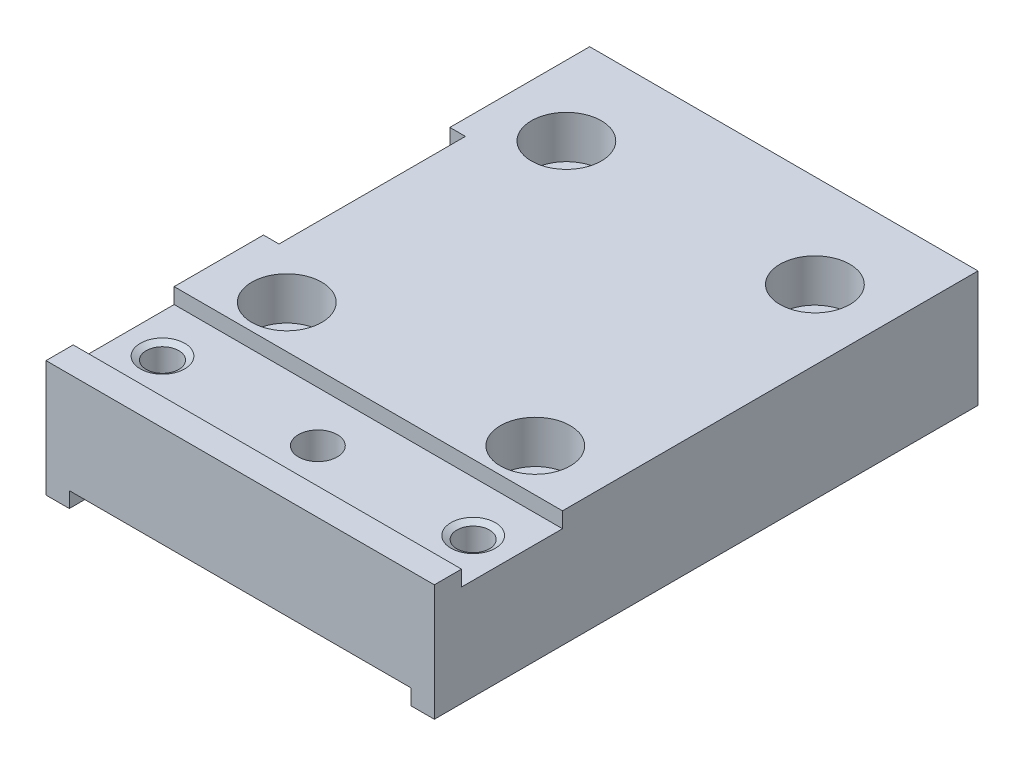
ISO-10303-21;
HEADER;
FILE_DESCRIPTION(('STEP AP214'),'2;1');
FILE_NAME('part.step','',(''),(''),'','','');
FILE_SCHEMA(('AUTOMOTIVE_DESIGN { 1 0 10303 214 1 1 1 1 }'));
ENDSEC;
DATA;
#1=APPLICATION_CONTEXT('core data for automotive mechanical design processes');
#2=APPLICATION_PROTOCOL_DEFINITION('international standard','automotive_design',2000,#1);
#3=PRODUCT_CONTEXT('',#1,'mechanical');
#4=PRODUCT('Part','Part','',(#3));
#5=PRODUCT_RELATED_PRODUCT_CATEGORY('part','',(#4));
#6=PRODUCT_DEFINITION_FORMATION('','',#4);
#7=PRODUCT_DEFINITION_CONTEXT('part definition',#1,'design');
#8=PRODUCT_DEFINITION('design','',#6,#7);
#9=PRODUCT_DEFINITION_SHAPE('','',#8);
#10=(LENGTH_UNIT() NAMED_UNIT(*) SI_UNIT(.MILLI.,.METRE.));
#11=(NAMED_UNIT(*) PLANE_ANGLE_UNIT() SI_UNIT($,.RADIAN.));
#12=(NAMED_UNIT(*) SI_UNIT($,.STERADIAN.) SOLID_ANGLE_UNIT());
#13=UNCERTAINTY_MEASURE_WITH_UNIT(LENGTH_MEASURE(1.E-05),#10,'distance_accuracy_value','');
#14=(GEOMETRIC_REPRESENTATION_CONTEXT(3) GLOBAL_UNCERTAINTY_ASSIGNED_CONTEXT((#13)) GLOBAL_UNIT_ASSIGNED_CONTEXT((#10,
#11,#12)) REPRESENTATION_CONTEXT('',''));
#15=CARTESIAN_POINT('',(0.,0.,0.));
#16=DIRECTION('',(0.,0.,1.));
#17=DIRECTION('',(1.,0.,0.));
#18=AXIS2_PLACEMENT_3D('',#15,#16,#17);
#19=CARTESIAN_POINT('',(-10.1999999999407,5.5,6.99999999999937));
#20=DIRECTION('',(-1.,0.,0.));
#21=DIRECTION('',(0.,0.,1.));
#22=AXIS2_PLACEMENT_3D('',#19,#20,#21);
#23=CONICAL_SURFACE('',#22,2.09999999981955,1.02974425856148);
#24=CARTESIAN_POINT('',(-8.93819270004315,5.5,6.99999999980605));
#25=VERTEX_POINT('',#24);
#26=VERTEX_LOOP('',#25);
#27=FACE_BOUND('',#26,.T.);
#28=CARTESIAN_POINT('',(-10.2,5.5,6.99999999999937));
#29=DIRECTION('',(-1.,0.,0.));
#30=DIRECTION('',(0.,0.,1.));
#31=AXIS2_PLACEMENT_3D('',#28,#29,#30);
#32=CIRCLE('',#31,2.1);
#33=CARTESIAN_POINT('',(-10.2,5.5,9.09999999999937));
#34=VERTEX_POINT('',#33);
#35=EDGE_CURVE('E160',#34,#34,#32,.T.);
#36=ORIENTED_EDGE('',*,*,#35,.T.);
#37=EDGE_LOOP('',(#36));
#38=FACE_BOUND('',#37,.T.);
#39=ADVANCED_FACE('F16',(#27,#38),#23,.F.);
#40=CARTESIAN_POINT('',(-10.1999999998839,5.5,-6.9999999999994));
#41=DIRECTION('',(-1.,0.,0.));
#42=DIRECTION('',(0.,0.,1.));
#43=AXIS2_PLACEMENT_3D('',#40,#41,#42);
#44=CONICAL_SURFACE('',#43,2.09999999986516,1.02974425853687);
#45=CARTESIAN_POINT('',(-8.93819269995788,5.5,-7.00000000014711));
#46=VERTEX_POINT('',#45);
#47=VERTEX_LOOP('',#46);
#48=FACE_BOUND('',#47,.T.);
#49=CARTESIAN_POINT('',(-10.2,5.5,-6.9999999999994));
#50=DIRECTION('',(-1.,0.,0.));
#51=DIRECTION('',(0.,0.,1.));
#52=AXIS2_PLACEMENT_3D('',#49,#50,#51);
#53=CIRCLE('',#52,2.1);
#54=CARTESIAN_POINT('',(-10.2,5.5,-4.8999999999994));
#55=VERTEX_POINT('',#54);
#56=EDGE_CURVE('E162',#55,#55,#53,.T.);
#57=ORIENTED_EDGE('',*,*,#56,.T.);
#58=EDGE_LOOP('',(#57));
#59=FACE_BOUND('',#58,.T.);
#60=ADVANCED_FACE('F157',(#48,#59),#44,.F.);
#61=CARTESIAN_POINT('',(-25.,5.5,6.99999999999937));
#62=DIRECTION('',(-1.,0.,0.));
#63=DIRECTION('',(0.,0.,1.));
#64=AXIS2_PLACEMENT_3D('',#61,#62,#63);
#65=CYLINDRICAL_SURFACE('',#64,2.1);
#66=ORIENTED_EDGE('',*,*,#35,.F.);
#67=EDGE_LOOP('',(#66));
#68=FACE_BOUND('',#67,.T.);
#69=CARTESIAN_POINT('',(-22.5612137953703,5.5,6.99999999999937));
#70=DIRECTION('',(-1.,0.,0.));
#71=DIRECTION('',(0.,1.,0.));
#72=AXIS2_PLACEMENT_3D('',#69,#70,#71);
#73=CIRCLE('',#72,2.10000000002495);
#74=CARTESIAN_POINT('',(-22.5612137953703,7.60000000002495,6.99999999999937));
#75=VERTEX_POINT('',#74);
#76=EDGE_CURVE('E165',#75,#75,#73,.T.);
#77=ORIENTED_EDGE('',*,*,#76,.T.);
#78=EDGE_LOOP('',(#77));
#79=FACE_BOUND('',#78,.T.);
#80=ADVANCED_FACE('F876',(#68,#79),#65,.F.);
#81=CARTESIAN_POINT('',(-25.,5.5,-6.9999999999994));
#82=DIRECTION('',(-1.,0.,0.));
#83=DIRECTION('',(0.,0.,1.));
#84=AXIS2_PLACEMENT_3D('',#81,#82,#83);
#85=CYLINDRICAL_SURFACE('',#84,2.1);
#86=ORIENTED_EDGE('',*,*,#56,.F.);
#87=EDGE_LOOP('',(#86));
#88=FACE_BOUND('',#87,.T.);
#89=CARTESIAN_POINT('',(-22.5612137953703,5.5,-6.9999999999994));
#90=DIRECTION('',(-1.,0.,0.));
#91=DIRECTION('',(0.,1.,0.));
#92=AXIS2_PLACEMENT_3D('',#89,#90,#91);
#93=CIRCLE('',#92,2.10000000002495);
#94=CARTESIAN_POINT('',(-22.5612137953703,7.60000000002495,-6.9999999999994));
#95=VERTEX_POINT('',#94);
#96=EDGE_CURVE('E261',#95,#95,#93,.T.);
#97=ORIENTED_EDGE('',*,*,#96,.T.);
#98=EDGE_LOOP('',(#97));
#99=FACE_BOUND('',#98,.T.);
#100=ADVANCED_FACE('F882',(#88,#99),#85,.F.);
#101=CARTESIAN_POINT('',(-22.9999999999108,5.5,6.99999999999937));
#102=DIRECTION('',(-1.,0.,0.));
#103=DIRECTION('',(0.,0.,1.));
#104=AXIS2_PLACEMENT_3D('',#101,#102,#103);
#105=CONICAL_SURFACE('',#104,2.85999999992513,1.0471975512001);
#106=CARTESIAN_POINT('',(-22.9999999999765,5.5,6.99999999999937));
#107=DIRECTION('',(-1.,0.,0.));
#108=DIRECTION('',(0.,0.,1.));
#109=AXIS2_PLACEMENT_3D('',#106,#107,#108);
#110=CIRCLE('',#109,2.86000000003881);
#111=CARTESIAN_POINT('',(-22.9999999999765,5.5,9.86000000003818));
#112=VERTEX_POINT('',#111);
#113=EDGE_CURVE('E19',#112,#112,#110,.T.);
#114=ORIENTED_EDGE('',*,*,#113,.T.);
#115=EDGE_LOOP('',(#114));
#116=FACE_BOUND('',#115,.T.);
#117=ORIENTED_EDGE('',*,*,#76,.F.);
#118=EDGE_LOOP('',(#117));
#119=FACE_BOUND('',#118,.T.);
#120=ADVANCED_FACE('F890',(#116,#119),#105,.F.);
#121=CARTESIAN_POINT('',(-22.9999999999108,5.5,-6.9999999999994));
#122=DIRECTION('',(-1.,0.,0.));
#123=DIRECTION('',(0.,0.,1.));
#124=AXIS2_PLACEMENT_3D('',#121,#122,#123);
#125=CONICAL_SURFACE('',#124,2.85999999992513,1.0471975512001);
#126=CARTESIAN_POINT('',(-22.9999999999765,5.5,-6.9999999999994));
#127=DIRECTION('',(-1.,0.,0.));
#128=DIRECTION('',(0.,0.,1.));
#129=AXIS2_PLACEMENT_3D('',#126,#127,#128);
#130=CIRCLE('',#129,2.86000000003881);
#131=CARTESIAN_POINT('',(-22.9999999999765,5.5,-4.13999999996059));
#132=VERTEX_POINT('',#131);
#133=EDGE_CURVE('E254',#132,#132,#130,.T.);
#134=ORIENTED_EDGE('',*,*,#133,.T.);
#135=EDGE_LOOP('',(#134));
#136=FACE_BOUND('',#135,.T.);
#137=ORIENTED_EDGE('',*,*,#96,.F.);
#138=EDGE_LOOP('',(#137));
#139=FACE_BOUND('',#138,.T.);
#140=ADVANCED_FACE('F899',(#136,#139),#125,.F.);
#141=CARTESIAN_POINT('',(1.05304653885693E-13,23.9999999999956,36.5));
#142=DIRECTION('',(0.,0.,1.));
#143=DIRECTION('',(1.,0.,0.));
#144=AXIS2_PLACEMENT_3D('',#141,#142,#143);
#145=PLANE('',#144);
#146=DIRECTION('',(0.,1.,0.));
#147=VECTOR('',#146,1.);
#148=CARTESIAN_POINT('',(25.,13.,36.5));
#149=LINE('',#148,#147);
#150=CARTESIAN_POINT('',(25.,13.,36.5));
#151=VERTEX_POINT('',#150);
#152=CARTESIAN_POINT('',(25.,10.9999999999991,36.5));
#153=VERTEX_POINT('',#152);
#154=EDGE_CURVE('E286',#151,#153,#149,.F.);
#155=ORIENTED_EDGE('',*,*,#154,.T.);
#156=DIRECTION('',(-1.,0.,0.));
#157=VECTOR('',#156,1.);
#158=CARTESIAN_POINT('',(21.,10.9999999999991,36.5));
#159=LINE('',#158,#157);
#160=CARTESIAN_POINT('',(-25.,10.9999999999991,36.5));
#161=VERTEX_POINT('',#160);
#162=EDGE_CURVE('E247',#161,#153,#159,.F.);
#163=ORIENTED_EDGE('',*,*,#162,.F.);
#164=DIRECTION('',(0.,1.,0.));
#165=VECTOR('',#164,1.);
#166=CARTESIAN_POINT('',(-25.,13.,36.5));
#167=LINE('',#166,#165);
#168=CARTESIAN_POINT('',(-25.,13.,36.5));
#169=VERTEX_POINT('',#168);
#170=EDGE_CURVE('E275',#161,#169,#167,.T.);
#171=ORIENTED_EDGE('',*,*,#170,.T.);
#172=DIRECTION('',(1.,0.,0.));
#173=VECTOR('',#172,1.);
#174=CARTESIAN_POINT('',(0.,13.,36.5));
#175=LINE('',#174,#173);
#176=EDGE_CURVE('E280',#169,#151,#175,.T.);
#177=ORIENTED_EDGE('',*,*,#176,.T.);
#178=EDGE_LOOP('',(#155,#163,#171,#177));
#179=FACE_BOUND('',#178,.T.);
#180=ADVANCED_FACE('F585',(#179),#145,.F.);
#181=CARTESIAN_POINT('',(-16.,13.,18.));
#182=DIRECTION('',(0.,1.,0.));
#183=DIRECTION('',(0.,0.,1.));
#184=AXIS2_PLACEMENT_3D('',#181,#182,#183);
#185=CYLINDRICAL_SURFACE('',#184,4.5);
#186=CARTESIAN_POINT('',(-16.,13.,18.));
#187=DIRECTION('',(0.,1.,0.));
#188=DIRECTION('',(0.,0.,1.));
#189=AXIS2_PLACEMENT_3D('',#186,#187,#188);
#190=CIRCLE('',#189,4.5);
#191=CARTESIAN_POINT('',(-16.,13.,22.5));
#192=VERTEX_POINT('',#191);
#193=EDGE_CURVE('E230',#192,#192,#190,.F.);
#194=ORIENTED_EDGE('',*,*,#193,.F.);
#195=EDGE_LOOP('',(#194));
#196=FACE_BOUND('',#195,.T.);
#197=CARTESIAN_POINT('',(-16.,7.5,18.));
#198=DIRECTION('',(0.,1.,0.));
#199=DIRECTION('',(0.,0.,1.));
#200=AXIS2_PLACEMENT_3D('',#197,#198,#199);
#201=CIRCLE('',#200,4.5);
#202=CARTESIAN_POINT('',(-16.,7.5,22.5));
#203=VERTEX_POINT('',#202);
#204=EDGE_CURVE('E244',#203,#203,#201,.T.);
#205=ORIENTED_EDGE('',*,*,#204,.F.);
#206=EDGE_LOOP('',(#205));
#207=FACE_BOUND('',#206,.T.);
#208=ADVANCED_FACE('F914',(#196,#207),#185,.F.);
#209=CARTESIAN_POINT('',(16.,13.,-18.));
#210=DIRECTION('',(0.,1.,0.));
#211=DIRECTION('',(0.,0.,1.));
#212=AXIS2_PLACEMENT_3D('',#209,#210,#211);
#213=CYLINDRICAL_SURFACE('',#212,4.5);
#214=CARTESIAN_POINT('',(16.,13.,-18.));
#215=DIRECTION('',(0.,1.,0.));
#216=DIRECTION('',(0.,0.,1.));
#217=AXIS2_PLACEMENT_3D('',#214,#215,#216);
#218=CIRCLE('',#217,4.5);
#219=CARTESIAN_POINT('',(16.,13.,-13.5));
#220=VERTEX_POINT('',#219);
#221=EDGE_CURVE('E227',#220,#220,#218,.F.);
#222=ORIENTED_EDGE('',*,*,#221,.F.);
#223=EDGE_LOOP('',(#222));
#224=FACE_BOUND('',#223,.T.);
#225=CARTESIAN_POINT('',(16.,7.5,-18.));
#226=DIRECTION('',(0.,1.,0.));
#227=DIRECTION('',(0.,0.,1.));
#228=AXIS2_PLACEMENT_3D('',#225,#226,#227);
#229=CIRCLE('',#228,4.5);
#230=CARTESIAN_POINT('',(16.,7.5,-13.5));
#231=VERTEX_POINT('',#230);
#232=EDGE_CURVE('E248',#231,#231,#229,.T.);
#233=ORIENTED_EDGE('',*,*,#232,.F.);
#234=EDGE_LOOP('',(#233));
#235=FACE_BOUND('',#234,.T.);
#236=ADVANCED_FACE('F922',(#224,#235),#213,.F.);
#237=CARTESIAN_POINT('',(-16.,13.,-18.));
#238=DIRECTION('',(0.,1.,0.));
#239=DIRECTION('',(0.,0.,1.));
#240=AXIS2_PLACEMENT_3D('',#237,#238,#239);
#241=CYLINDRICAL_SURFACE('',#240,4.5);
#242=CARTESIAN_POINT('',(-16.,13.,-18.));
#243=DIRECTION('',(0.,1.,0.));
#244=DIRECTION('',(0.,0.,1.));
#245=AXIS2_PLACEMENT_3D('',#242,#243,#244);
#246=CIRCLE('',#245,4.5);
#247=CARTESIAN_POINT('',(-16.,13.,-13.5));
#248=VERTEX_POINT('',#247);
#249=EDGE_CURVE('E224',#248,#248,#246,.F.);
#250=ORIENTED_EDGE('',*,*,#249,.F.);
#251=EDGE_LOOP('',(#250));
#252=FACE_BOUND('',#251,.T.);
#253=CARTESIAN_POINT('',(-16.,7.5,-18.));
#254=DIRECTION('',(0.,1.,0.));
#255=DIRECTION('',(0.,0.,1.));
#256=AXIS2_PLACEMENT_3D('',#253,#254,#255);
#257=CIRCLE('',#256,4.5);
#258=CARTESIAN_POINT('',(-16.,7.5,-13.5));
#259=VERTEX_POINT('',#258);
#260=EDGE_CURVE('E251',#259,#259,#257,.T.);
#261=ORIENTED_EDGE('',*,*,#260,.F.);
#262=EDGE_LOOP('',(#261));
#263=FACE_BOUND('',#262,.T.);
#264=ADVANCED_FACE('F602',(#252,#263),#241,.F.);
#265=CARTESIAN_POINT('',(16.,13.,18.));
#266=DIRECTION('',(0.,1.,0.));
#267=DIRECTION('',(0.,0.,1.));
#268=AXIS2_PLACEMENT_3D('',#265,#266,#267);
#269=CYLINDRICAL_SURFACE('',#268,4.5);
#270=CARTESIAN_POINT('',(16.,13.,18.));
#271=DIRECTION('',(0.,1.,0.));
#272=DIRECTION('',(0.,0.,1.));
#273=AXIS2_PLACEMENT_3D('',#270,#271,#272);
#274=CIRCLE('',#273,4.5);
#275=CARTESIAN_POINT('',(16.,13.,22.5));
#276=VERTEX_POINT('',#275);
#277=EDGE_CURVE('E220',#276,#276,#274,.F.);
#278=ORIENTED_EDGE('',*,*,#277,.F.);
#279=EDGE_LOOP('',(#278));
#280=FACE_BOUND('',#279,.T.);
#281=CARTESIAN_POINT('',(16.,7.5,18.));
#282=DIRECTION('',(0.,1.,0.));
#283=DIRECTION('',(0.,0.,1.));
#284=AXIS2_PLACEMENT_3D('',#281,#282,#283);
#285=CIRCLE('',#284,4.5);
#286=CARTESIAN_POINT('',(16.,7.5,22.5));
#287=VERTEX_POINT('',#286);
#288=EDGE_CURVE('E239',#287,#287,#285,.T.);
#289=ORIENTED_EDGE('',*,*,#288,.F.);
#290=EDGE_LOOP('',(#289));
#291=FACE_BOUND('',#290,.T.);
#292=ADVANCED_FACE('F593',(#280,#291),#269,.F.);
#293=CARTESIAN_POINT('',(1.00159580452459E-13,23.9999999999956,23.5));
#294=DIRECTION('',(0.,0.,1.));
#295=DIRECTION('',(1.,0.,0.));
#296=AXIS2_PLACEMENT_3D('',#293,#294,#295);
#297=PLANE('',#296);
#298=DIRECTION('',(-1.,0.,0.));
#299=VECTOR('',#298,1.);
#300=CARTESIAN_POINT('',(21.,12.9999999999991,23.5));
#301=LINE('',#300,#299);
#302=CARTESIAN_POINT('',(-25.,12.9999999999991,23.5));
#303=VERTEX_POINT('',#302);
#304=CARTESIAN_POINT('',(25.,12.9999999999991,23.5));
#305=VERTEX_POINT('',#304);
#306=EDGE_CURVE('E314',#303,#305,#301,.F.);
#307=ORIENTED_EDGE('',*,*,#306,.F.);
#308=DIRECTION('',(0.,1.,0.));
#309=VECTOR('',#308,1.);
#310=CARTESIAN_POINT('',(-25.,13.,23.5));
#311=LINE('',#310,#309);
#312=CARTESIAN_POINT('',(-25.,10.9999999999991,23.5));
#313=VERTEX_POINT('',#312);
#314=EDGE_CURVE('E276',#303,#313,#311,.F.);
#315=ORIENTED_EDGE('',*,*,#314,.T.);
#316=DIRECTION('',(-1.,0.,0.));
#317=VECTOR('',#316,1.);
#318=CARTESIAN_POINT('',(21.,10.9999999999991,23.5));
#319=LINE('',#318,#317);
#320=CARTESIAN_POINT('',(25.,10.9999999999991,23.5));
#321=VERTEX_POINT('',#320);
#322=EDGE_CURVE('E243',#321,#313,#319,.T.);
#323=ORIENTED_EDGE('',*,*,#322,.F.);
#324=DIRECTION('',(0.,1.,0.));
#325=VECTOR('',#324,1.);
#326=CARTESIAN_POINT('',(25.,13.,23.5));
#327=LINE('',#326,#325);
#328=EDGE_CURVE('E233',#321,#305,#327,.T.);
#329=ORIENTED_EDGE('',*,*,#328,.T.);
#330=EDGE_LOOP('',(#307,#315,#323,#329));
#331=FACE_BOUND('',#330,.T.);
#332=ADVANCED_FACE('F591',(#331),#297,.T.);
#333=CARTESIAN_POINT('',(-23.,14.9999999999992,11.9999999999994));
#334=DIRECTION('',(0.,0.,-1.));
#335=DIRECTION('',(0.,1.,0.));
#336=AXIS2_PLACEMENT_3D('',#333,#334,#335);
#337=PLANE('',#336);
#338=DIRECTION('',(0.,1.,0.));
#339=VECTOR('',#338,1.);
#340=CARTESIAN_POINT('',(-25.,13.,11.9999999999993));
#341=LINE('',#340,#339);
#342=CARTESIAN_POINT('',(-25.,-2.,11.9999999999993));
#343=VERTEX_POINT('',#342);
#344=CARTESIAN_POINT('',(-25.,12.9999999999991,11.9999999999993));
#345=VERTEX_POINT('',#344);
#346=EDGE_CURVE('E242',#343,#345,#341,.T.);
#347=ORIENTED_EDGE('',*,*,#346,.T.);
#348=DIRECTION('',(-1.,0.,0.));
#349=VECTOR('',#348,1.);
#350=CARTESIAN_POINT('',(21.,12.9999999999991,11.9999999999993));
#351=LINE('',#350,#349);
#352=CARTESIAN_POINT('',(-23.,12.9999999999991,11.9999999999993));
#353=VERTEX_POINT('',#352);
#354=EDGE_CURVE('E303',#353,#345,#351,.T.);
#355=ORIENTED_EDGE('',*,*,#354,.F.);
#356=DIRECTION('',(0.,1.,0.));
#357=VECTOR('',#356,1.);
#358=CARTESIAN_POINT('',(-23.,13.,11.9999999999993));
#359=LINE('',#358,#357);
#360=CARTESIAN_POINT('',(-23.,-2.,11.9999999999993));
#361=VERTEX_POINT('',#360);
#362=EDGE_CURVE('E256',#353,#361,#359,.F.);
#363=ORIENTED_EDGE('',*,*,#362,.T.);
#364=DIRECTION('',(1.,0.,0.));
#365=VECTOR('',#364,1.);
#366=CARTESIAN_POINT('',(0.,-2.,11.9999999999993));
#367=LINE('',#366,#365);
#368=EDGE_CURVE('E338',#343,#361,#367,.T.);
#369=ORIENTED_EDGE('',*,*,#368,.F.);
#370=EDGE_LOOP('',(#347,#355,#363,#369));
#371=FACE_BOUND('',#370,.T.);
#372=ADVANCED_FACE('F543',(#371),#337,.T.);
#373=CARTESIAN_POINT('',(-23.,13.,-29.));
#374=DIRECTION('',(1.,0.,0.));
#375=DIRECTION('',(0.,0.,-1.));
#376=AXIS2_PLACEMENT_3D('',#373,#374,#375);
#377=PLANE('',#376);
#378=DIRECTION('',(0.,0.,-1.));
#379=VECTOR('',#378,1.);
#380=CARTESIAN_POINT('',(-23.,-2.,0.));
#381=LINE('',#380,#379);
#382=CARTESIAN_POINT('',(-23.,-2.,-11.9999999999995));
#383=VERTEX_POINT('',#382);
#384=EDGE_CURVE('E341',#361,#383,#381,.T.);
#385=ORIENTED_EDGE('',*,*,#384,.F.);
#386=ORIENTED_EDGE('',*,*,#362,.F.);
#387=DIRECTION('',(0.,0.,1.));
#388=VECTOR('',#387,1.);
#389=CARTESIAN_POINT('',(-23.,12.9999999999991,21.5));
#390=LINE('',#389,#388);
#391=CARTESIAN_POINT('',(-23.,12.9999999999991,-11.9999999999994));
#392=VERTEX_POINT('',#391);
#393=EDGE_CURVE('E223',#392,#353,#390,.T.);
#394=ORIENTED_EDGE('',*,*,#393,.F.);
#395=DIRECTION('',(0.,-1.,0.));
#396=VECTOR('',#395,1.);
#397=CARTESIAN_POINT('',(-23.,14.9999999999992,-11.9999999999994));
#398=LINE('',#397,#396);
#399=EDGE_CURVE('E253',#383,#392,#398,.F.);
#400=ORIENTED_EDGE('',*,*,#399,.F.);
#401=EDGE_LOOP('',(#385,#386,#394,#400));
#402=FACE_BOUND('',#401,.T.);
#403=ORIENTED_EDGE('',*,*,#133,.F.);
#404=EDGE_LOOP('',(#403));
#405=FACE_BOUND('',#404,.T.);
#406=ORIENTED_EDGE('',*,*,#113,.F.);
#407=EDGE_LOOP('',(#406));
#408=FACE_BOUND('',#407,.T.);
#409=ADVANCED_FACE('F546',(#402,#405,#408),#377,.F.);
#410=CARTESIAN_POINT('',(-23.,14.9999999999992,-11.9999999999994));
#411=DIRECTION('',(0.,0.,1.));
#412=DIRECTION('',(0.,-1.,0.));
#413=AXIS2_PLACEMENT_3D('',#410,#411,#412);
#414=PLANE('',#413);
#415=ORIENTED_EDGE('',*,*,#399,.T.);
#416=DIRECTION('',(-1.,0.,0.));
#417=VECTOR('',#416,1.);
#418=CARTESIAN_POINT('',(21.,12.9999999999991,-11.9999999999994));
#419=LINE('',#418,#417);
#420=CARTESIAN_POINT('',(-25.,12.9999999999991,-11.9999999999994));
#421=VERTEX_POINT('',#420);
#422=EDGE_CURVE('E329',#421,#392,#419,.F.);
#423=ORIENTED_EDGE('',*,*,#422,.F.);
#424=DIRECTION('',(0.,1.,0.));
#425=VECTOR('',#424,1.);
#426=CARTESIAN_POINT('',(-25.,13.,-11.9999999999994));
#427=LINE('',#426,#425);
#428=CARTESIAN_POINT('',(-25.,-2.,-11.9999999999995));
#429=VERTEX_POINT('',#428);
#430=EDGE_CURVE('E360',#421,#429,#427,.F.);
#431=ORIENTED_EDGE('',*,*,#430,.T.);
#432=DIRECTION('',(1.,0.,0.));
#433=VECTOR('',#432,1.);
#434=CARTESIAN_POINT('',(0.,-2.,-11.9999999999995));
#435=LINE('',#434,#433);
#436=EDGE_CURVE('E349',#383,#429,#435,.F.);
#437=ORIENTED_EDGE('',*,*,#436,.F.);
#438=EDGE_LOOP('',(#415,#423,#431,#437));
#439=FACE_BOUND('',#438,.T.);
#440=ADVANCED_FACE('F550',(#439),#414,.T.);
#441=CARTESIAN_POINT('',(-16.,7.5,-18.));
#442=DIRECTION('',(0.,1.,0.));
#443=DIRECTION('',(0.,0.,1.));
#444=AXIS2_PLACEMENT_3D('',#441,#442,#443);
#445=PLANE('',#444);
#446=CARTESIAN_POINT('',(-16.,7.5,-18.));
#447=DIRECTION('',(0.,1.,0.));
#448=DIRECTION('',(0.,0.,1.));
#449=AXIS2_PLACEMENT_3D('',#446,#447,#448);
#450=CIRCLE('',#449,2.5);
#451=CARTESIAN_POINT('',(-16.,7.5,-15.5));
#452=VERTEX_POINT('',#451);
#453=EDGE_CURVE('E212',#452,#452,#450,.F.);
#454=ORIENTED_EDGE('',*,*,#453,.T.);
#455=EDGE_LOOP('',(#454));
#456=FACE_BOUND('',#455,.T.);
#457=ORIENTED_EDGE('',*,*,#260,.T.);
#458=EDGE_LOOP('',(#457));
#459=FACE_BOUND('',#458,.T.);
#460=ADVANCED_FACE('F683',(#456,#459),#445,.T.);
#461=CARTESIAN_POINT('',(16.,7.5,-18.));
#462=DIRECTION('',(0.,1.,0.));
#463=DIRECTION('',(0.,0.,1.));
#464=AXIS2_PLACEMENT_3D('',#461,#462,#463);
#465=PLANE('',#464);
#466=CARTESIAN_POINT('',(16.,7.5,-18.));
#467=DIRECTION('',(0.,1.,0.));
#468=DIRECTION('',(0.,0.,1.));
#469=AXIS2_PLACEMENT_3D('',#466,#467,#468);
#470=CIRCLE('',#469,2.5);
#471=CARTESIAN_POINT('',(16.,7.5,-15.5));
#472=VERTEX_POINT('',#471);
#473=EDGE_CURVE('E209',#472,#472,#470,.F.);
#474=ORIENTED_EDGE('',*,*,#473,.T.);
#475=EDGE_LOOP('',(#474));
#476=FACE_BOUND('',#475,.T.);
#477=ORIENTED_EDGE('',*,*,#232,.T.);
#478=EDGE_LOOP('',(#477));
#479=FACE_BOUND('',#478,.T.);
#480=ADVANCED_FACE('F679',(#476,#479),#465,.T.);
#481=CARTESIAN_POINT('',(-16.,7.5,18.));
#482=DIRECTION('',(0.,1.,0.));
#483=DIRECTION('',(0.,0.,1.));
#484=AXIS2_PLACEMENT_3D('',#481,#482,#483);
#485=PLANE('',#484);
#486=CARTESIAN_POINT('',(-16.,7.5,18.));
#487=DIRECTION('',(0.,1.,0.));
#488=DIRECTION('',(0.,0.,1.));
#489=AXIS2_PLACEMENT_3D('',#486,#487,#488);
#490=CIRCLE('',#489,2.5);
#491=CARTESIAN_POINT('',(-16.,7.5,20.5));
#492=VERTEX_POINT('',#491);
#493=EDGE_CURVE('E206',#492,#492,#490,.F.);
#494=ORIENTED_EDGE('',*,*,#493,.T.);
#495=EDGE_LOOP('',(#494));
#496=FACE_BOUND('',#495,.T.);
#497=ORIENTED_EDGE('',*,*,#204,.T.);
#498=EDGE_LOOP('',(#497));
#499=FACE_BOUND('',#498,.T.);
#500=ADVANCED_FACE('F676',(#496,#499),#485,.T.);
#501=CARTESIAN_POINT('',(21.,10.9999999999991,51.5));
#502=DIRECTION('',(0.,1.,0.));
#503=DIRECTION('',(-1.,0.,0.));
#504=AXIS2_PLACEMENT_3D('',#501,#502,#503);
#505=PLANE('',#504);
#506=DIRECTION('',(0.,0.,1.));
#507=VECTOR('',#506,1.);
#508=CARTESIAN_POINT('',(25.,10.9999999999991,-29.));
#509=LINE('',#508,#507);
#510=EDGE_CURVE('E288',#153,#321,#509,.F.);
#511=ORIENTED_EDGE('',*,*,#510,.T.);
#512=ORIENTED_EDGE('',*,*,#322,.T.);
#513=DIRECTION('',(0.,0.,-1.));
#514=VECTOR('',#513,1.);
#515=CARTESIAN_POINT('',(-25.,10.9999999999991,-29.));
#516=LINE('',#515,#514);
#517=EDGE_CURVE('E272',#313,#161,#516,.F.);
#518=ORIENTED_EDGE('',*,*,#517,.T.);
#519=ORIENTED_EDGE('',*,*,#162,.T.);
#520=EDGE_LOOP('',(#511,#512,#518,#519));
#521=FACE_BOUND('',#520,.T.);
#522=CARTESIAN_POINT('',(1.13686837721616E-13,10.9999999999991,30.));
#523=DIRECTION('',(0.,1.,0.));
#524=DIRECTION('',(-1.,0.,0.));
#525=AXIS2_PLACEMENT_3D('',#522,#523,#524);
#526=CIRCLE('',#525,2.5);
#527=CARTESIAN_POINT('',(-2.49999999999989,10.9999999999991,30.));
#528=VERTEX_POINT('',#527);
#529=EDGE_CURVE('E203',#528,#528,#526,.F.);
#530=ORIENTED_EDGE('',*,*,#529,.T.);
#531=EDGE_LOOP('',(#530));
#532=FACE_BOUND('',#531,.T.);
#533=CARTESIAN_POINT('',(-20.,11.0000000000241,30.));
#534=DIRECTION('',(0.,1.,0.));
#535=DIRECTION('',(0.,0.,1.));
#536=AXIS2_PLACEMENT_3D('',#533,#534,#535);
#537=CIRCLE('',#536,2.85999999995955);
#538=CARTESIAN_POINT('',(-20.,11.0000000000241,32.8599999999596));
#539=VERTEX_POINT('',#538);
#540=EDGE_CURVE('E234',#539,#539,#537,.F.);
#541=ORIENTED_EDGE('',*,*,#540,.T.);
#542=EDGE_LOOP('',(#541));
#543=FACE_BOUND('',#542,.T.);
#544=CARTESIAN_POINT('',(20.,11.0000000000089,30.));
#545=DIRECTION('',(0.,1.,0.));
#546=DIRECTION('',(0.,0.,1.));
#547=AXIS2_PLACEMENT_3D('',#544,#545,#546);
#548=CIRCLE('',#547,2.85999999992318);
#549=CARTESIAN_POINT('',(20.,11.0000000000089,32.8599999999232));
#550=VERTEX_POINT('',#549);
#551=EDGE_CURVE('E216',#550,#550,#548,.F.);
#552=ORIENTED_EDGE('',*,*,#551,.T.);
#553=EDGE_LOOP('',(#552));
#554=FACE_BOUND('',#553,.T.);
#555=ADVANCED_FACE('F587',(#521,#532,#543,#554),#505,.T.);
#556=CARTESIAN_POINT('',(16.,7.5,18.));
#557=DIRECTION('',(0.,1.,0.));
#558=DIRECTION('',(0.,0.,1.));
#559=AXIS2_PLACEMENT_3D('',#556,#557,#558);
#560=PLANE('',#559);
#561=CARTESIAN_POINT('',(16.,7.5,18.));
#562=DIRECTION('',(0.,1.,0.));
#563=DIRECTION('',(0.,0.,1.));
#564=AXIS2_PLACEMENT_3D('',#561,#562,#563);
#565=CIRCLE('',#564,2.5);
#566=CARTESIAN_POINT('',(16.,7.5,20.5));
#567=VERTEX_POINT('',#566);
#568=EDGE_CURVE('E199',#567,#567,#565,.F.);
#569=ORIENTED_EDGE('',*,*,#568,.T.);
#570=EDGE_LOOP('',(#569));
#571=FACE_BOUND('',#570,.T.);
#572=ORIENTED_EDGE('',*,*,#288,.T.);
#573=EDGE_LOOP('',(#572));
#574=FACE_BOUND('',#573,.T.);
#575=ADVANCED_FACE('F670',(#571,#574),#560,.T.);
#576=CARTESIAN_POINT('',(-25.,13.,-29.));
#577=DIRECTION('',(1.,0.,0.));
#578=DIRECTION('',(0.,0.,-1.));
#579=AXIS2_PLACEMENT_3D('',#576,#577,#578);
#580=PLANE('',#579);
#581=ORIENTED_EDGE('',*,*,#170,.F.);
#582=ORIENTED_EDGE('',*,*,#517,.F.);
#583=ORIENTED_EDGE('',*,*,#314,.F.);
#584=DIRECTION('',(0.,0.,1.));
#585=VECTOR('',#584,1.);
#586=CARTESIAN_POINT('',(-25.,12.9999999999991,21.5));
#587=LINE('',#586,#585);
#588=EDGE_CURVE('E306',#345,#303,#587,.T.);
#589=ORIENTED_EDGE('',*,*,#588,.F.);
#590=ORIENTED_EDGE('',*,*,#346,.F.);
#591=DIRECTION('',(0.,0.,-1.));
#592=VECTOR('',#591,1.);
#593=CARTESIAN_POINT('',(-25.,-2.,0.));
#594=LINE('',#593,#592);
#595=CARTESIAN_POINT('',(-25.,-2.,40.));
#596=VERTEX_POINT('',#595);
#597=EDGE_CURVE('E342',#596,#343,#594,.T.);
#598=ORIENTED_EDGE('',*,*,#597,.F.);
#599=DIRECTION('',(0.,1.,0.));
#600=VECTOR('',#599,1.);
#601=CARTESIAN_POINT('',(-25.,13.,40.));
#602=LINE('',#601,#600);
#603=CARTESIAN_POINT('',(-25.,13.,40.));
#604=VERTEX_POINT('',#603);
#605=EDGE_CURVE('E202',#596,#604,#602,.T.);
#606=ORIENTED_EDGE('',*,*,#605,.T.);
#607=DIRECTION('',(0.,0.,-1.));
#608=VECTOR('',#607,1.);
#609=CARTESIAN_POINT('',(-25.,13.,0.));
#610=LINE('',#609,#608);
#611=EDGE_CURVE('E238',#604,#169,#610,.T.);
#612=ORIENTED_EDGE('',*,*,#611,.T.);
#613=EDGE_LOOP('',(#581,#582,#583,#589,#590,#598,#606,#612));
#614=FACE_BOUND('',#613,.T.);
#615=ADVANCED_FACE('F538',(#614),#580,.F.);
#616=CARTESIAN_POINT('',(0.,13.,0.));
#617=DIRECTION('',(0.,-1.,0.));
#618=DIRECTION('',(0.,0.,-1.));
#619=AXIS2_PLACEMENT_3D('',#616,#617,#618);
#620=PLANE('',#619);
#621=DIRECTION('',(-1.,0.,0.));
#622=VECTOR('',#621,1.);
#623=CARTESIAN_POINT('',(20.,13.,40.));
#624=LINE('',#623,#622);
#625=CARTESIAN_POINT('',(25.,13.,40.));
#626=VERTEX_POINT('',#625);
#627=EDGE_CURVE('E368',#604,#626,#624,.F.);
#628=ORIENTED_EDGE('',*,*,#627,.T.);
#629=DIRECTION('',(0.,0.,1.));
#630=VECTOR('',#629,1.);
#631=CARTESIAN_POINT('',(25.,13.,-29.));
#632=LINE('',#631,#630);
#633=EDGE_CURVE('E237',#626,#151,#632,.F.);
#634=ORIENTED_EDGE('',*,*,#633,.T.);
#635=ORIENTED_EDGE('',*,*,#176,.F.);
#636=ORIENTED_EDGE('',*,*,#611,.F.);
#637=EDGE_LOOP('',(#628,#634,#635,#636));
#638=FACE_BOUND('',#637,.T.);
#639=ADVANCED_FACE('F581',(#638),#620,.F.);
#640=CARTESIAN_POINT('',(-20.,11.0000000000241,30.));
#641=DIRECTION('',(0.,1.,0.));
#642=DIRECTION('',(0.,0.,1.));
#643=AXIS2_PLACEMENT_3D('',#640,#641,#642);
#644=CONICAL_SURFACE('',#643,2.85999999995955,1.0471975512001);
#645=ORIENTED_EDGE('',*,*,#540,.F.);
#646=EDGE_LOOP('',(#645));
#647=FACE_BOUND('',#646,.T.);
#648=CARTESIAN_POINT('',(-20.,10.561213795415,30.));
#649=DIRECTION('',(0.,1.,0.));
#650=DIRECTION('',(-1.,0.,0.));
#651=AXIS2_PLACEMENT_3D('',#648,#649,#650);
#652=CIRCLE('',#651,2.1);
#653=CARTESIAN_POINT('',(-22.1,10.561213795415,30.));
#654=VERTEX_POINT('',#653);
#655=EDGE_CURVE('E197',#654,#654,#652,.F.);
#656=ORIENTED_EDGE('',*,*,#655,.T.);
#657=EDGE_LOOP('',(#656));
#658=FACE_BOUND('',#657,.T.);
#659=ADVANCED_FACE('F662',(#647,#658),#644,.F.);
#660=CARTESIAN_POINT('',(25.,13.,-29.));
#661=DIRECTION('',(-1.,0.,0.));
#662=DIRECTION('',(0.,0.,1.));
#663=AXIS2_PLACEMENT_3D('',#660,#661,#662);
#664=PLANE('',#663);
#665=ORIENTED_EDGE('',*,*,#328,.F.);
#666=ORIENTED_EDGE('',*,*,#510,.F.);
#667=ORIENTED_EDGE('',*,*,#154,.F.);
#668=ORIENTED_EDGE('',*,*,#633,.F.);
#669=DIRECTION('',(0.,1.,0.));
#670=VECTOR('',#669,1.);
#671=CARTESIAN_POINT('',(25.,13.,40.));
#672=LINE('',#671,#670);
#673=CARTESIAN_POINT('',(25.,-2.,40.));
#674=VERTEX_POINT('',#673);
#675=EDGE_CURVE('E370',#626,#674,#672,.F.);
#676=ORIENTED_EDGE('',*,*,#675,.T.);
#677=DIRECTION('',(0.,0.,-1.));
#678=VECTOR('',#677,1.);
#679=CARTESIAN_POINT('',(25.,-2.,0.));
#680=LINE('',#679,#678);
#681=CARTESIAN_POINT('',(25.,-2.,-30.));
#682=VERTEX_POINT('',#681);
#683=EDGE_CURVE('E215',#682,#674,#680,.F.);
#684=ORIENTED_EDGE('',*,*,#683,.F.);
#685=DIRECTION('',(0.,1.,0.));
#686=VECTOR('',#685,1.);
#687=CARTESIAN_POINT('',(25.,13.,-30.));
#688=LINE('',#687,#686);
#689=CARTESIAN_POINT('',(25.,12.9999999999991,-30.));
#690=VERTEX_POINT('',#689);
#691=EDGE_CURVE('E402',#682,#690,#688,.T.);
#692=ORIENTED_EDGE('',*,*,#691,.T.);
#693=DIRECTION('',(0.,0.,1.));
#694=VECTOR('',#693,1.);
#695=CARTESIAN_POINT('',(25.,12.9999999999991,21.5));
#696=LINE('',#695,#694);
#697=EDGE_CURVE('E319',#305,#690,#696,.F.);
#698=ORIENTED_EDGE('',*,*,#697,.F.);
#699=EDGE_LOOP('',(#665,#666,#667,#668,#676,#684,#692,#698));
#700=FACE_BOUND('',#699,.T.);
#701=ADVANCED_FACE('F564',(#700),#664,.F.);
#702=CARTESIAN_POINT('',(21.,12.9999999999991,21.5));
#703=DIRECTION('',(0.,1.,0.));
#704=DIRECTION('',(-1.,0.,0.));
#705=AXIS2_PLACEMENT_3D('',#702,#703,#704);
#706=PLANE('',#705);
#707=DIRECTION('',(0.,0.,-1.));
#708=VECTOR('',#707,1.);
#709=CARTESIAN_POINT('',(-25.,12.9999999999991,-29.));
#710=LINE('',#709,#708);
#711=CARTESIAN_POINT('',(-25.,12.9999999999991,-30.));
#712=VERTEX_POINT('',#711);
#713=EDGE_CURVE('E332',#712,#421,#710,.F.);
#714=ORIENTED_EDGE('',*,*,#713,.T.);
#715=ORIENTED_EDGE('',*,*,#422,.T.);
#716=ORIENTED_EDGE('',*,*,#393,.T.);
#717=ORIENTED_EDGE('',*,*,#354,.T.);
#718=ORIENTED_EDGE('',*,*,#588,.T.);
#719=ORIENTED_EDGE('',*,*,#306,.T.);
#720=ORIENTED_EDGE('',*,*,#697,.T.);
#721=DIRECTION('',(1.,0.,0.));
#722=VECTOR('',#721,1.);
#723=CARTESIAN_POINT('',(20.,12.9999999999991,-30.));
#724=LINE('',#723,#722);
#725=EDGE_CURVE('E404',#690,#712,#724,.F.);
#726=ORIENTED_EDGE('',*,*,#725,.T.);
#727=EDGE_LOOP('',(#714,#715,#716,#717,#718,#719,#720,#726));
#728=FACE_BOUND('',#727,.T.);
#729=ORIENTED_EDGE('',*,*,#277,.T.);
#730=EDGE_LOOP('',(#729));
#731=FACE_BOUND('',#730,.T.);
#732=ORIENTED_EDGE('',*,*,#249,.T.);
#733=EDGE_LOOP('',(#732));
#734=FACE_BOUND('',#733,.T.);
#735=ORIENTED_EDGE('',*,*,#221,.T.);
#736=EDGE_LOOP('',(#735));
#737=FACE_BOUND('',#736,.T.);
#738=ORIENTED_EDGE('',*,*,#193,.T.);
#739=EDGE_LOOP('',(#738));
#740=FACE_BOUND('',#739,.T.);
#741=ADVANCED_FACE('F558',(#728,#731,#734,#737,#740),#706,.T.);
#742=CARTESIAN_POINT('',(-25.,13.,-29.));
#743=DIRECTION('',(1.,0.,0.));
#744=DIRECTION('',(0.,0.,-1.));
#745=AXIS2_PLACEMENT_3D('',#742,#743,#744);
#746=PLANE('',#745);
#747=ORIENTED_EDGE('',*,*,#713,.F.);
#748=DIRECTION('',(0.,1.,0.));
#749=VECTOR('',#748,1.);
#750=CARTESIAN_POINT('',(-25.,13.,-30.));
#751=LINE('',#750,#749);
#752=CARTESIAN_POINT('',(-25.,-2.,-30.));
#753=VERTEX_POINT('',#752);
#754=EDGE_CURVE('E413',#712,#753,#751,.F.);
#755=ORIENTED_EDGE('',*,*,#754,.T.);
#756=DIRECTION('',(0.,0.,-1.));
#757=VECTOR('',#756,1.);
#758=CARTESIAN_POINT('',(-25.,-2.,0.));
#759=LINE('',#758,#757);
#760=EDGE_CURVE('E219',#429,#753,#759,.T.);
#761=ORIENTED_EDGE('',*,*,#760,.F.);
#762=ORIENTED_EDGE('',*,*,#430,.F.);
#763=EDGE_LOOP('',(#747,#755,#761,#762));
#764=FACE_BOUND('',#763,.T.);
#765=ADVANCED_FACE('F554',(#764),#746,.F.);
#766=CARTESIAN_POINT('',(0.,-2.,0.));
#767=DIRECTION('',(0.,-1.,0.));
#768=DIRECTION('',(0.,0.,-1.));
#769=AXIS2_PLACEMENT_3D('',#766,#767,#768);
#770=PLANE('',#769);
#771=ORIENTED_EDGE('',*,*,#760,.T.);
#772=DIRECTION('',(1.,0.,0.));
#773=VECTOR('',#772,1.);
#774=CARTESIAN_POINT('',(20.,-2.,-30.));
#775=LINE('',#774,#773);
#776=CARTESIAN_POINT('',(-22.,-2.,-30.));
#777=VERTEX_POINT('',#776);
#778=EDGE_CURVE('E421',#753,#777,#775,.T.);
#779=ORIENTED_EDGE('',*,*,#778,.T.);
#780=DIRECTION('',(0.,0.,1.));
#781=VECTOR('',#780,1.);
#782=CARTESIAN_POINT('',(-22.,-2.,-29.));
#783=LINE('',#782,#781);
#784=CARTESIAN_POINT('',(-22.,-2.,29.3596875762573));
#785=VERTEX_POINT('',#784);
#786=EDGE_CURVE('E64',#777,#785,#783,.T.);
#787=ORIENTED_EDGE('',*,*,#786,.T.);
#788=CARTESIAN_POINT('',(-20.,-2.,30.));
#789=DIRECTION('',(0.,1.,0.));
#790=DIRECTION('',(-1.,0.,0.));
#791=AXIS2_PLACEMENT_3D('',#788,#789,#790);
#792=CIRCLE('',#791,2.1);
#793=CARTESIAN_POINT('',(-22.,-2.,30.6403124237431));
#794=VERTEX_POINT('',#793);
#795=EDGE_CURVE('E71',#785,#794,#792,.T.);
#796=ORIENTED_EDGE('',*,*,#795,.T.);
#797=DIRECTION('',(0.,0.,1.));
#798=VECTOR('',#797,1.);
#799=CARTESIAN_POINT('',(-22.,-2.,-29.));
#800=LINE('',#799,#798);
#801=CARTESIAN_POINT('',(-22.,-2.,40.));
#802=VERTEX_POINT('',#801);
#803=EDGE_CURVE('E76',#794,#802,#800,.T.);
#804=ORIENTED_EDGE('',*,*,#803,.T.);
#805=DIRECTION('',(-1.,0.,0.));
#806=VECTOR('',#805,1.);
#807=CARTESIAN_POINT('',(20.,-2.,40.));
#808=LINE('',#807,#806);
#809=EDGE_CURVE('E388',#802,#596,#808,.T.);
#810=ORIENTED_EDGE('',*,*,#809,.T.);
#811=ORIENTED_EDGE('',*,*,#597,.T.);
#812=ORIENTED_EDGE('',*,*,#368,.T.);
#813=ORIENTED_EDGE('',*,*,#384,.T.);
#814=ORIENTED_EDGE('',*,*,#436,.T.);
#815=EDGE_LOOP('',(#771,#779,#787,#796,#804,#810,#811,#812,#813,#814));
#816=FACE_BOUND('',#815,.T.);
#817=ADVANCED_FACE('F512',(#816),#770,.T.);
#818=CARTESIAN_POINT('',(20.,10.9999999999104,30.));
#819=DIRECTION('',(0.,1.,0.));
#820=DIRECTION('',(0.,0.,1.));
#821=AXIS2_PLACEMENT_3D('',#818,#819,#820);
#822=CONICAL_SURFACE('',#821,2.85999999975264,1.04719755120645);
#823=ORIENTED_EDGE('',*,*,#551,.F.);
#824=EDGE_LOOP('',(#823));
#825=FACE_BOUND('',#824,.T.);
#826=CARTESIAN_POINT('',(20.,10.561213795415,30.));
#827=DIRECTION('',(0.,1.,0.));
#828=DIRECTION('',(-1.,0.,0.));
#829=AXIS2_PLACEMENT_3D('',#826,#827,#828);
#830=CIRCLE('',#829,2.1);
#831=CARTESIAN_POINT('',(17.9,10.561213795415,30.));
#832=VERTEX_POINT('',#831);
#833=EDGE_CURVE('E194',#832,#832,#830,.F.);
#834=ORIENTED_EDGE('',*,*,#833,.T.);
#835=EDGE_LOOP('',(#834));
#836=FACE_BOUND('',#835,.T.);
#837=ADVANCED_FACE('F650',(#825,#836),#822,.F.);
#838=CARTESIAN_POINT('',(0.,-2.,0.));
#839=DIRECTION('',(0.,-1.,0.));
#840=DIRECTION('',(0.,0.,-1.));
#841=AXIS2_PLACEMENT_3D('',#838,#839,#840);
#842=PLANE('',#841);
#843=ORIENTED_EDGE('',*,*,#683,.T.);
#844=DIRECTION('',(-1.,0.,0.));
#845=VECTOR('',#844,1.);
#846=CARTESIAN_POINT('',(20.,-2.,40.));
#847=LINE('',#846,#845);
#848=CARTESIAN_POINT('',(22.,-2.,40.));
#849=VERTEX_POINT('',#848);
#850=EDGE_CURVE('E378',#674,#849,#847,.T.);
#851=ORIENTED_EDGE('',*,*,#850,.T.);
#852=DIRECTION('',(0.,0.,-1.));
#853=VECTOR('',#852,1.);
#854=CARTESIAN_POINT('',(22.,-2.,-29.));
#855=LINE('',#854,#853);
#856=CARTESIAN_POINT('',(22.,-2.,30.6403124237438));
#857=VERTEX_POINT('',#856);
#858=EDGE_CURVE('E452',#849,#857,#855,.T.);
#859=ORIENTED_EDGE('',*,*,#858,.T.);
#860=CARTESIAN_POINT('',(20.,-2.,30.));
#861=DIRECTION('',(0.,1.,0.));
#862=DIRECTION('',(-1.,0.,0.));
#863=AXIS2_PLACEMENT_3D('',#860,#861,#862);
#864=CIRCLE('',#863,2.1);
#865=CARTESIAN_POINT('',(22.,-2.,29.3596875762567));
#866=VERTEX_POINT('',#865);
#867=EDGE_CURVE('E192',#857,#866,#864,.T.);
#868=ORIENTED_EDGE('',*,*,#867,.T.);
#869=DIRECTION('',(0.,0.,-1.));
#870=VECTOR('',#869,1.);
#871=CARTESIAN_POINT('',(22.,-2.,-29.));
#872=LINE('',#871,#870);
#873=CARTESIAN_POINT('',(22.,-2.,-30.));
#874=VERTEX_POINT('',#873);
#875=EDGE_CURVE('E440',#866,#874,#872,.T.);
#876=ORIENTED_EDGE('',*,*,#875,.T.);
#877=DIRECTION('',(1.,0.,0.));
#878=VECTOR('',#877,1.);
#879=CARTESIAN_POINT('',(20.,-2.,-30.));
#880=LINE('',#879,#878);
#881=EDGE_CURVE('E405',#874,#682,#880,.T.);
#882=ORIENTED_EDGE('',*,*,#881,.T.);
#883=EDGE_LOOP('',(#843,#851,#859,#868,#876,#882));
#884=FACE_BOUND('',#883,.T.);
#885=ADVANCED_FACE('F570',(#884),#842,.T.);
#886=CARTESIAN_POINT('',(-16.,13.,-18.));
#887=DIRECTION('',(0.,1.,0.));
#888=DIRECTION('',(0.,0.,1.));
#889=AXIS2_PLACEMENT_3D('',#886,#887,#888);
#890=CYLINDRICAL_SURFACE('',#889,2.5);
#891=ORIENTED_EDGE('',*,*,#453,.F.);
#892=EDGE_LOOP('',(#891));
#893=FACE_BOUND('',#892,.T.);
#894=CARTESIAN_POINT('',(-16.,0.,-18.));
#895=DIRECTION('',(0.,1.,0.));
#896=DIRECTION('',(0.,0.,1.));
#897=AXIS2_PLACEMENT_3D('',#894,#895,#896);
#898=CIRCLE('',#897,2.5);
#899=CARTESIAN_POINT('',(-16.,0.,-15.5));
#900=VERTEX_POINT('',#899);
#901=EDGE_CURVE('E188',#900,#900,#898,.T.);
#902=ORIENTED_EDGE('',*,*,#901,.F.);
#903=EDGE_LOOP('',(#902));
#904=FACE_BOUND('',#903,.T.);
#905=ADVANCED_FACE('F643',(#893,#904),#890,.F.);
#906=CARTESIAN_POINT('',(16.,13.,-18.));
#907=DIRECTION('',(0.,1.,0.));
#908=DIRECTION('',(0.,0.,1.));
#909=AXIS2_PLACEMENT_3D('',#906,#907,#908);
#910=CYLINDRICAL_SURFACE('',#909,2.5);
#911=ORIENTED_EDGE('',*,*,#473,.F.);
#912=EDGE_LOOP('',(#911));
#913=FACE_BOUND('',#912,.T.);
#914=CARTESIAN_POINT('',(16.,0.,-18.));
#915=DIRECTION('',(0.,1.,0.));
#916=DIRECTION('',(0.,0.,1.));
#917=AXIS2_PLACEMENT_3D('',#914,#915,#916);
#918=CIRCLE('',#917,2.5);
#919=CARTESIAN_POINT('',(16.,0.,-15.5));
#920=VERTEX_POINT('',#919);
#921=EDGE_CURVE('E185',#920,#920,#918,.T.);
#922=ORIENTED_EDGE('',*,*,#921,.F.);
#923=EDGE_LOOP('',(#922));
#924=FACE_BOUND('',#923,.T.);
#925=ADVANCED_FACE('F639',(#913,#924),#910,.F.);
#926=CARTESIAN_POINT('',(-16.,13.,18.));
#927=DIRECTION('',(0.,1.,0.));
#928=DIRECTION('',(0.,0.,1.));
#929=AXIS2_PLACEMENT_3D('',#926,#927,#928);
#930=CYLINDRICAL_SURFACE('',#929,2.5);
#931=ORIENTED_EDGE('',*,*,#493,.F.);
#932=EDGE_LOOP('',(#931));
#933=FACE_BOUND('',#932,.T.);
#934=CARTESIAN_POINT('',(-16.,0.,18.));
#935=DIRECTION('',(0.,1.,0.));
#936=DIRECTION('',(0.,0.,1.));
#937=AXIS2_PLACEMENT_3D('',#934,#935,#936);
#938=CIRCLE('',#937,2.5);
#939=CARTESIAN_POINT('',(-16.,0.,20.5));
#940=VERTEX_POINT('',#939);
#941=EDGE_CURVE('E182',#940,#940,#938,.T.);
#942=ORIENTED_EDGE('',*,*,#941,.F.);
#943=EDGE_LOOP('',(#942));
#944=FACE_BOUND('',#943,.T.);
#945=ADVANCED_FACE('F635',(#933,#944),#930,.F.);
#946=CARTESIAN_POINT('',(1.13686837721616E-13,10.9999999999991,30.));
#947=DIRECTION('',(0.,1.,0.));
#948=DIRECTION('',(-1.,0.,0.));
#949=AXIS2_PLACEMENT_3D('',#946,#947,#948);
#950=CYLINDRICAL_SURFACE('',#949,2.5);
#951=ORIENTED_EDGE('',*,*,#529,.F.);
#952=EDGE_LOOP('',(#951));
#953=FACE_BOUND('',#952,.T.);
#954=CARTESIAN_POINT('',(1.02288548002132E-13,0.,30.));
#955=DIRECTION('',(0.,1.,0.));
#956=DIRECTION('',(-1.,0.,0.));
#957=AXIS2_PLACEMENT_3D('',#954,#955,#956);
#958=CIRCLE('',#957,2.5);
#959=CARTESIAN_POINT('',(-2.4999999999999,0.,30.));
#960=VERTEX_POINT('',#959);
#961=EDGE_CURVE('E179',#960,#960,#958,.T.);
#962=ORIENTED_EDGE('',*,*,#961,.F.);
#963=EDGE_LOOP('',(#962));
#964=FACE_BOUND('',#963,.T.);
#965=ADVANCED_FACE('F631',(#953,#964),#950,.F.);
#966=CARTESIAN_POINT('',(16.,13.,18.));
#967=DIRECTION('',(0.,1.,0.));
#968=DIRECTION('',(0.,0.,1.));
#969=AXIS2_PLACEMENT_3D('',#966,#967,#968);
#970=CYLINDRICAL_SURFACE('',#969,2.5);
#971=ORIENTED_EDGE('',*,*,#568,.F.);
#972=EDGE_LOOP('',(#971));
#973=FACE_BOUND('',#972,.T.);
#974=CARTESIAN_POINT('',(16.,0.,18.));
#975=DIRECTION('',(0.,1.,0.));
#976=DIRECTION('',(0.,0.,1.));
#977=AXIS2_PLACEMENT_3D('',#974,#975,#976);
#978=CIRCLE('',#977,2.5);
#979=CARTESIAN_POINT('',(16.,0.,20.5));
#980=VERTEX_POINT('',#979);
#981=EDGE_CURVE('E175',#980,#980,#978,.T.);
#982=ORIENTED_EDGE('',*,*,#981,.F.);
#983=EDGE_LOOP('',(#982));
#984=FACE_BOUND('',#983,.T.);
#985=ADVANCED_FACE('F628',(#973,#984),#970,.F.);
#986=CARTESIAN_POINT('',(20.,13.,40.));
#987=DIRECTION('',(0.,0.,-1.));
#988=DIRECTION('',(-1.,0.,0.));
#989=AXIS2_PLACEMENT_3D('',#986,#987,#988);
#990=PLANE('',#989);
#991=DIRECTION('',(0.,1.,0.));
#992=VECTOR('',#991,1.);
#993=CARTESIAN_POINT('',(-22.,0.,40.));
#994=LINE('',#993,#992);
#995=CARTESIAN_POINT('',(-22.,0.,40.));
#996=VERTEX_POINT('',#995);
#997=EDGE_CURVE('E393',#802,#996,#994,.T.);
#998=ORIENTED_EDGE('',*,*,#997,.T.);
#999=DIRECTION('',(1.,0.,0.));
#1000=VECTOR('',#999,1.);
#1001=CARTESIAN_POINT('',(0.,0.,40.));
#1002=LINE('',#1001,#1000);
#1003=CARTESIAN_POINT('',(22.,0.,40.));
#1004=VERTEX_POINT('',#1003);
#1005=EDGE_CURVE('E178',#1004,#996,#1002,.F.);
#1006=ORIENTED_EDGE('',*,*,#1005,.F.);
#1007=DIRECTION('',(0.,1.,0.));
#1008=VECTOR('',#1007,1.);
#1009=CARTESIAN_POINT('',(22.,0.,40.));
#1010=LINE('',#1009,#1008);
#1011=EDGE_CURVE('E446',#1004,#849,#1010,.F.);
#1012=ORIENTED_EDGE('',*,*,#1011,.T.);
#1013=ORIENTED_EDGE('',*,*,#850,.F.);
#1014=ORIENTED_EDGE('',*,*,#675,.F.);
#1015=ORIENTED_EDGE('',*,*,#627,.F.);
#1016=ORIENTED_EDGE('',*,*,#605,.F.);
#1017=ORIENTED_EDGE('',*,*,#809,.F.);
#1018=EDGE_LOOP('',(#998,#1006,#1012,#1013,#1014,#1015,#1016,#1017));
#1019=FACE_BOUND('',#1018,.T.);
#1020=ADVANCED_FACE('F531',(#1019),#990,.F.);
#1021=CARTESIAN_POINT('',(-22.,0.,-29.));
#1022=DIRECTION('',(-1.,0.,0.));
#1023=DIRECTION('',(0.,0.,1.));
#1024=AXIS2_PLACEMENT_3D('',#1021,#1022,#1023);
#1025=PLANE('',#1024);
#1026=DIRECTION('',(0.,0.,-1.));
#1027=VECTOR('',#1026,1.);
#1028=CARTESIAN_POINT('',(-22.,0.,0.));
#1029=LINE('',#1028,#1027);
#1030=CARTESIAN_POINT('',(-22.,0.,30.6403124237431));
#1031=VERTEX_POINT('',#1030);
#1032=EDGE_CURVE('E174',#996,#1031,#1029,.T.);
#1033=ORIENTED_EDGE('',*,*,#1032,.F.);
#1034=ORIENTED_EDGE('',*,*,#997,.F.);
#1035=ORIENTED_EDGE('',*,*,#803,.F.);
#1036=DIRECTION('',(0.,1.,0.));
#1037=VECTOR('',#1036,1.);
#1038=CARTESIAN_POINT('',(-22.,10.9999999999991,30.6403124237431));
#1039=LINE('',#1038,#1037);
#1040=EDGE_CURVE('E198',#794,#1031,#1039,.T.);
#1041=ORIENTED_EDGE('',*,*,#1040,.T.);
#1042=EDGE_LOOP('',(#1033,#1034,#1035,#1041));
#1043=FACE_BOUND('',#1042,.T.);
#1044=ADVANCED_FACE('F527',(#1043),#1025,.F.);
#1045=CARTESIAN_POINT('',(-20.,10.9999999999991,30.));
#1046=DIRECTION('',(0.,1.,0.));
#1047=DIRECTION('',(-1.,0.,0.));
#1048=AXIS2_PLACEMENT_3D('',#1045,#1046,#1047);
#1049=CYLINDRICAL_SURFACE('',#1048,2.1);
#1050=ORIENTED_EDGE('',*,*,#655,.F.);
#1051=EDGE_LOOP('',(#1050));
#1052=FACE_BOUND('',#1051,.T.);
#1053=ORIENTED_EDGE('',*,*,#1040,.F.);
#1054=ORIENTED_EDGE('',*,*,#795,.F.);
#1055=DIRECTION('',(0.,1.,0.));
#1056=VECTOR('',#1055,1.);
#1057=CARTESIAN_POINT('',(-22.,0.,29.3596875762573));
#1058=LINE('',#1057,#1056);
#1059=CARTESIAN_POINT('',(-22.,0.,29.3596875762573));
#1060=VERTEX_POINT('',#1059);
#1061=EDGE_CURVE('E433',#785,#1060,#1058,.T.);
#1062=ORIENTED_EDGE('',*,*,#1061,.T.);
#1063=CARTESIAN_POINT('',(-20.,0.,30.));
#1064=DIRECTION('',(0.,1.,0.));
#1065=DIRECTION('',(-1.,0.,0.));
#1066=AXIS2_PLACEMENT_3D('',#1063,#1064,#1065);
#1067=CIRCLE('',#1066,2.1);
#1068=EDGE_CURVE('E171',#1031,#1060,#1067,.T.);
#1069=ORIENTED_EDGE('',*,*,#1068,.F.);
#1070=EDGE_LOOP('',(#1053,#1054,#1062,#1069));
#1071=FACE_BOUND('',#1070,.T.);
#1072=ADVANCED_FACE('F525',(#1052,#1071),#1049,.F.);
#1073=CARTESIAN_POINT('',(-22.,0.,-29.));
#1074=DIRECTION('',(-1.,0.,0.));
#1075=DIRECTION('',(0.,0.,1.));
#1076=AXIS2_PLACEMENT_3D('',#1073,#1074,#1075);
#1077=PLANE('',#1076);
#1078=ORIENTED_EDGE('',*,*,#1061,.F.);
#1079=ORIENTED_EDGE('',*,*,#786,.F.);
#1080=DIRECTION('',(0.,1.,0.));
#1081=VECTOR('',#1080,1.);
#1082=CARTESIAN_POINT('',(-22.,13.,-30.));
#1083=LINE('',#1082,#1081);
#1084=CARTESIAN_POINT('',(-22.,0.,-30.));
#1085=VERTEX_POINT('',#1084);
#1086=EDGE_CURVE('E429',#777,#1085,#1083,.T.);
#1087=ORIENTED_EDGE('',*,*,#1086,.T.);
#1088=DIRECTION('',(0.,0.,-1.));
#1089=VECTOR('',#1088,1.);
#1090=CARTESIAN_POINT('',(-22.,0.,0.));
#1091=LINE('',#1090,#1089);
#1092=EDGE_CURVE('E173',#1060,#1085,#1091,.T.);
#1093=ORIENTED_EDGE('',*,*,#1092,.F.);
#1094=EDGE_LOOP('',(#1078,#1079,#1087,#1093));
#1095=FACE_BOUND('',#1094,.T.);
#1096=ADVANCED_FACE('F518',(#1095),#1077,.F.);
#1097=CARTESIAN_POINT('',(20.,13.,-30.));
#1098=DIRECTION('',(0.,0.,1.));
#1099=DIRECTION('',(1.,0.,0.));
#1100=AXIS2_PLACEMENT_3D('',#1097,#1098,#1099);
#1101=PLANE('',#1100);
#1102=ORIENTED_EDGE('',*,*,#1086,.F.);
#1103=ORIENTED_EDGE('',*,*,#778,.F.);
#1104=ORIENTED_EDGE('',*,*,#754,.F.);
#1105=ORIENTED_EDGE('',*,*,#725,.F.);
#1106=ORIENTED_EDGE('',*,*,#691,.F.);
#1107=ORIENTED_EDGE('',*,*,#881,.F.);
#1108=DIRECTION('',(0.,1.,0.));
#1109=VECTOR('',#1108,1.);
#1110=CARTESIAN_POINT('',(22.,0.,-30.));
#1111=LINE('',#1110,#1109);
#1112=CARTESIAN_POINT('',(22.,0.,-30.));
#1113=VERTEX_POINT('',#1112);
#1114=EDGE_CURVE('E443',#874,#1113,#1111,.T.);
#1115=ORIENTED_EDGE('',*,*,#1114,.T.);
#1116=DIRECTION('',(1.,0.,0.));
#1117=VECTOR('',#1116,1.);
#1118=CARTESIAN_POINT('',(0.,0.,-30.));
#1119=LINE('',#1118,#1117);
#1120=EDGE_CURVE('E467',#1085,#1113,#1119,.T.);
#1121=ORIENTED_EDGE('',*,*,#1120,.F.);
#1122=EDGE_LOOP('',(#1102,#1103,#1104,#1105,#1106,#1107,#1115,#1121));
#1123=FACE_BOUND('',#1122,.T.);
#1124=ADVANCED_FACE('F520',(#1123),#1101,.F.);
#1125=CARTESIAN_POINT('',(22.,0.,-29.));
#1126=DIRECTION('',(1.,0.,0.));
#1127=DIRECTION('',(0.,0.,-1.));
#1128=AXIS2_PLACEMENT_3D('',#1125,#1126,#1127);
#1129=PLANE('',#1128);
#1130=DIRECTION('',(0.,0.,-1.));
#1131=VECTOR('',#1130,1.);
#1132=CARTESIAN_POINT('',(22.,0.,0.));
#1133=LINE('',#1132,#1131);
#1134=CARTESIAN_POINT('',(22.,0.,29.3596875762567));
#1135=VERTEX_POINT('',#1134);
#1136=EDGE_CURVE('E170',#1113,#1135,#1133,.F.);
#1137=ORIENTED_EDGE('',*,*,#1136,.F.);
#1138=ORIENTED_EDGE('',*,*,#1114,.F.);
#1139=ORIENTED_EDGE('',*,*,#875,.F.);
#1140=DIRECTION('',(0.,1.,0.));
#1141=VECTOR('',#1140,1.);
#1142=CARTESIAN_POINT('',(22.,10.9999999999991,29.3596875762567));
#1143=LINE('',#1142,#1141);
#1144=EDGE_CURVE('E195',#866,#1135,#1143,.T.);
#1145=ORIENTED_EDGE('',*,*,#1144,.T.);
#1146=EDGE_LOOP('',(#1137,#1138,#1139,#1145));
#1147=FACE_BOUND('',#1146,.T.);
#1148=ADVANCED_FACE('F502',(#1147),#1129,.F.);
#1149=CARTESIAN_POINT('',(20.,10.9999999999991,30.));
#1150=DIRECTION('',(0.,1.,0.));
#1151=DIRECTION('',(-1.,0.,0.));
#1152=AXIS2_PLACEMENT_3D('',#1149,#1150,#1151);
#1153=CYLINDRICAL_SURFACE('',#1152,2.1);
#1154=DIRECTION('',(0.,1.,0.));
#1155=VECTOR('',#1154,1.);
#1156=CARTESIAN_POINT('',(22.,0.,30.6403124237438));
#1157=LINE('',#1156,#1155);
#1158=CARTESIAN_POINT('',(22.,0.,30.6403124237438));
#1159=VERTEX_POINT('',#1158);
#1160=EDGE_CURVE('E191',#857,#1159,#1157,.T.);
#1161=ORIENTED_EDGE('',*,*,#1160,.T.);
#1162=CARTESIAN_POINT('',(20.,0.,30.));
#1163=DIRECTION('',(0.,1.,0.));
#1164=DIRECTION('',(-1.,0.,0.));
#1165=AXIS2_PLACEMENT_3D('',#1162,#1163,#1164);
#1166=CIRCLE('',#1165,2.1);
#1167=EDGE_CURVE('E25',#1135,#1159,#1166,.T.);
#1168=ORIENTED_EDGE('',*,*,#1167,.F.);
#1169=ORIENTED_EDGE('',*,*,#1144,.F.);
#1170=ORIENTED_EDGE('',*,*,#867,.F.);
#1171=EDGE_LOOP('',(#1161,#1168,#1169,#1170));
#1172=FACE_BOUND('',#1171,.T.);
#1173=ORIENTED_EDGE('',*,*,#833,.F.);
#1174=EDGE_LOOP('',(#1173));
#1175=FACE_BOUND('',#1174,.T.);
#1176=ADVANCED_FACE('F573',(#1172,#1175),#1153,.F.);
#1177=CARTESIAN_POINT('',(22.,0.,-29.));
#1178=DIRECTION('',(1.,0.,0.));
#1179=DIRECTION('',(0.,0.,-1.));
#1180=AXIS2_PLACEMENT_3D('',#1177,#1178,#1179);
#1181=PLANE('',#1180);
#1182=ORIENTED_EDGE('',*,*,#1160,.F.);
#1183=ORIENTED_EDGE('',*,*,#858,.F.);
#1184=ORIENTED_EDGE('',*,*,#1011,.F.);
#1185=DIRECTION('',(0.,0.,-1.));
#1186=VECTOR('',#1185,1.);
#1187=CARTESIAN_POINT('',(22.,0.,0.));
#1188=LINE('',#1187,#1186);
#1189=EDGE_CURVE('E11',#1159,#1004,#1188,.F.);
#1190=ORIENTED_EDGE('',*,*,#1189,.F.);
#1191=EDGE_LOOP('',(#1182,#1183,#1184,#1190));
#1192=FACE_BOUND('',#1191,.T.);
#1193=ADVANCED_FACE('F579',(#1192),#1181,.F.);
#1194=CARTESIAN_POINT('',(0.,0.,0.));
#1195=DIRECTION('',(0.,-1.,0.));
#1196=DIRECTION('',(0.,0.,-1.));
#1197=AXIS2_PLACEMENT_3D('',#1194,#1195,#1196);
#1198=PLANE('',#1197);
#1199=ORIENTED_EDGE('',*,*,#1167,.T.);
#1200=ORIENTED_EDGE('',*,*,#1189,.T.);
#1201=ORIENTED_EDGE('',*,*,#1005,.T.);
#1202=ORIENTED_EDGE('',*,*,#1032,.T.);
#1203=ORIENTED_EDGE('',*,*,#1068,.T.);
#1204=ORIENTED_EDGE('',*,*,#1092,.T.);
#1205=ORIENTED_EDGE('',*,*,#1120,.T.);
#1206=ORIENTED_EDGE('',*,*,#1136,.T.);
#1207=EDGE_LOOP('',(#1199,#1200,#1201,#1202,#1203,#1204,#1205,#1206));
#1208=FACE_BOUND('',#1207,.T.);
#1209=ORIENTED_EDGE('',*,*,#981,.T.);
#1210=EDGE_LOOP('',(#1209));
#1211=FACE_BOUND('',#1210,.T.);
#1212=ORIENTED_EDGE('',*,*,#961,.T.);
#1213=EDGE_LOOP('',(#1212));
#1214=FACE_BOUND('',#1213,.T.);
#1215=ORIENTED_EDGE('',*,*,#941,.T.);
#1216=EDGE_LOOP('',(#1215));
#1217=FACE_BOUND('',#1216,.T.);
#1218=ORIENTED_EDGE('',*,*,#921,.T.);
#1219=EDGE_LOOP('',(#1218));
#1220=FACE_BOUND('',#1219,.T.);
#1221=ORIENTED_EDGE('',*,*,#901,.T.);
#1222=EDGE_LOOP('',(#1221));
#1223=FACE_BOUND('',#1222,.T.);
#1224=ADVANCED_FACE('F497',(#1208,#1211,#1214,#1217,#1220,#1223),#1198,.T.);
#1225=CLOSED_SHELL('',(#39,#60,#80,#100,#120,#140,#180,#208,#236,#264,#292,#332,#372,#409,#440,
#460,#480,#500,#555,#575,#615,#639,#659,#701,#741,#765,#817,#837,#885,#905,#925,#945,#965,#985,
#1020,#1044,#1072,#1096,#1124,#1148,#1176,#1193,#1224));
#1226=MANIFOLD_SOLID_BREP('B1',#1225);
#1227=ADVANCED_BREP_SHAPE_REPRESENTATION('',(#18,#1226),#14);
#1228=SHAPE_DEFINITION_REPRESENTATION(#9,#1227);
ENDSEC;
END-ISO-10303-21;
